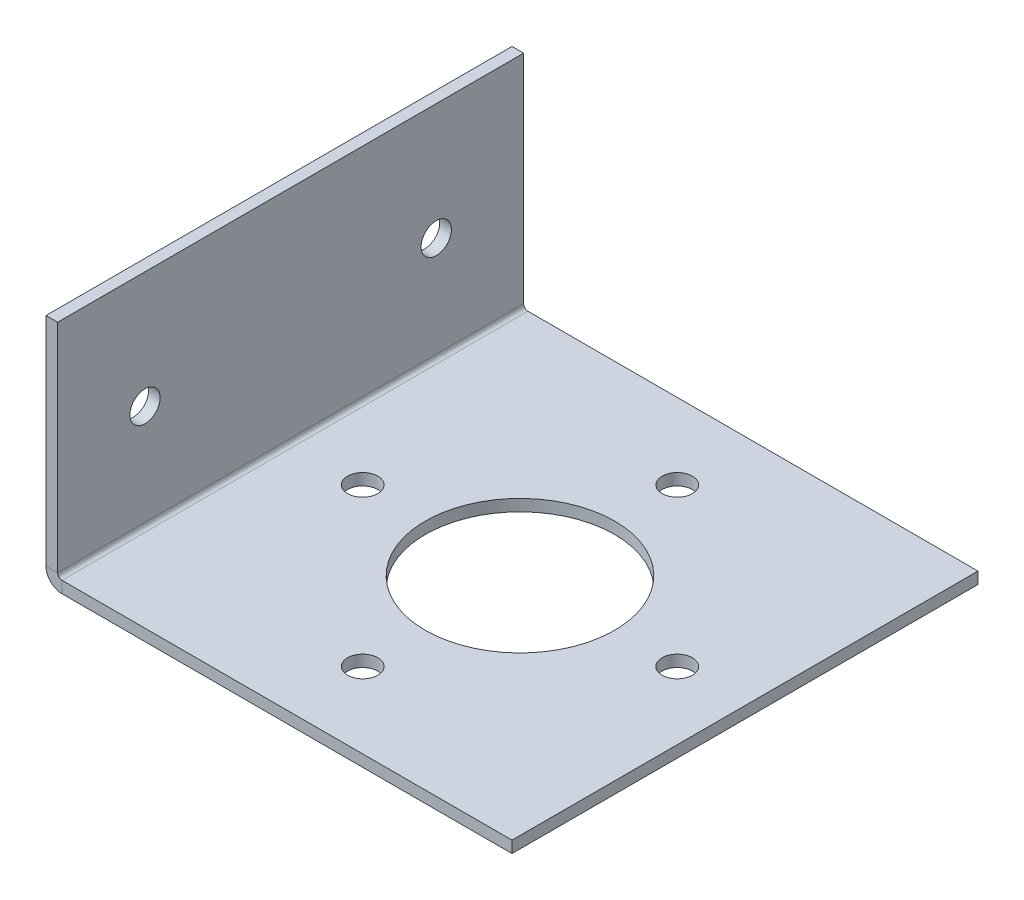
ISO-10303-21;
HEADER;
FILE_DESCRIPTION(('STEP AP214'),'2;1');
FILE_NAME('part.step','',(''),(''),'','','');
FILE_SCHEMA(('AUTOMOTIVE_DESIGN { 1 0 10303 214 1 1 1 1 }'));
ENDSEC;
DATA;
#1=APPLICATION_CONTEXT('core data for automotive mechanical design processes');
#2=APPLICATION_PROTOCOL_DEFINITION('international standard','automotive_design',2000,#1);
#3=PRODUCT_CONTEXT('',#1,'mechanical');
#4=PRODUCT('Part','Part','',(#3));
#5=PRODUCT_RELATED_PRODUCT_CATEGORY('part','',(#4));
#6=PRODUCT_DEFINITION_FORMATION('','',#4);
#7=PRODUCT_DEFINITION_CONTEXT('part definition',#1,'design');
#8=PRODUCT_DEFINITION('design','',#6,#7);
#9=PRODUCT_DEFINITION_SHAPE('','',#8);
#10=(LENGTH_UNIT() NAMED_UNIT(*) SI_UNIT(.MILLI.,.METRE.));
#11=(NAMED_UNIT(*) PLANE_ANGLE_UNIT() SI_UNIT($,.RADIAN.));
#12=(NAMED_UNIT(*) SI_UNIT($,.STERADIAN.) SOLID_ANGLE_UNIT());
#13=UNCERTAINTY_MEASURE_WITH_UNIT(LENGTH_MEASURE(1.E-05),#10,'distance_accuracy_value','');
#14=(GEOMETRIC_REPRESENTATION_CONTEXT(3) GLOBAL_UNCERTAINTY_ASSIGNED_CONTEXT((#13)) GLOBAL_UNIT_ASSIGNED_CONTEXT((#10,
#11,#12)) REPRESENTATION_CONTEXT('',''));
#15=CARTESIAN_POINT('',(0.,0.,0.));
#16=DIRECTION('',(0.,0.,1.));
#17=DIRECTION('',(1.,0.,0.));
#18=AXIS2_PLACEMENT_3D('',#15,#16,#17);
#19=CARTESIAN_POINT('',(0.,2.7366,80.));
#20=DIRECTION('',(0.,0.,1.));
#21=DIRECTION('',(1.,0.,0.));
#22=AXIS2_PLACEMENT_3D('',#19,#20,#21);
#23=PLANE('',#22);
#24=DIRECTION('',(1.,0.,0.));
#25=VECTOR('',#24,1.);
#26=CARTESIAN_POINT('',(0.,2.7366,80.));
#27=LINE('',#26,#25);
#28=CARTESIAN_POINT('',(0.,2.7366,80.));
#29=VERTEX_POINT('',#28);
#30=CARTESIAN_POINT('',(2.,2.7366,80.));
#31=VERTEX_POINT('',#30);
#32=EDGE_CURVE('E11',#29,#31,#27,.T.);
#33=ORIENTED_EDGE('',*,*,#32,.F.);
#34=CARTESIAN_POINT('',(2.7366,2.7366,80.));
#35=DIRECTION('',(0.,0.,1.));
#36=DIRECTION('',(1.,0.,0.));
#37=AXIS2_PLACEMENT_3D('',#34,#35,#36);
#38=CIRCLE('',#37,2.7366);
#39=CARTESIAN_POINT('',(2.7366,0.,80.));
#40=VERTEX_POINT('',#39);
#41=EDGE_CURVE('E147',#40,#29,#38,.F.);
#42=ORIENTED_EDGE('',*,*,#41,.F.);
#43=DIRECTION('',(0.,-1.,0.));
#44=VECTOR('',#43,1.);
#45=CARTESIAN_POINT('',(2.7366,2.,80.));
#46=LINE('',#45,#44);
#47=CARTESIAN_POINT('',(2.7366,2.,80.));
#48=VERTEX_POINT('',#47);
#49=EDGE_CURVE('E57',#48,#40,#46,.T.);
#50=ORIENTED_EDGE('',*,*,#49,.F.);
#51=CARTESIAN_POINT('',(2.7366,2.7366,80.));
#52=DIRECTION('',(0.,0.,1.));
#53=DIRECTION('',(1.,0.,0.));
#54=AXIS2_PLACEMENT_3D('',#51,#52,#53);
#55=CIRCLE('',#54,0.7366);
#56=EDGE_CURVE('E140',#48,#31,#55,.F.);
#57=ORIENTED_EDGE('',*,*,#56,.T.);
#58=EDGE_LOOP('',(#33,#42,#50,#57));
#59=FACE_BOUND('',#58,.T.);
#60=ADVANCED_FACE('F48',(#59),#23,.T.);
#61=CARTESIAN_POINT('',(2.7366,2.,80.));
#62=DIRECTION('',(0.,0.,1.));
#63=DIRECTION('',(1.,0.,0.));
#64=AXIS2_PLACEMENT_3D('',#61,#62,#63);
#65=PLANE('',#64);
#66=DIRECTION('',(0.,1.,0.));
#67=VECTOR('',#66,1.);
#68=CARTESIAN_POINT('',(0.,0.,80.));
#69=LINE('',#68,#67);
#70=CARTESIAN_POINT('',(0.,40.,80.));
#71=VERTEX_POINT('',#70);
#72=EDGE_CURVE('E238',#29,#71,#69,.T.);
#73=ORIENTED_EDGE('',*,*,#72,.F.);
#74=ORIENTED_EDGE('',*,*,#32,.T.);
#75=DIRECTION('',(0.,1.,0.));
#76=VECTOR('',#75,1.);
#77=CARTESIAN_POINT('',(2.,0.,80.));
#78=LINE('',#77,#76);
#79=CARTESIAN_POINT('',(2.,40.,80.));
#80=VERTEX_POINT('',#79);
#81=EDGE_CURVE('E106',#31,#80,#78,.T.);
#82=ORIENTED_EDGE('',*,*,#81,.T.);
#83=DIRECTION('',(1.,0.,0.));
#84=VECTOR('',#83,1.);
#85=CARTESIAN_POINT('',(0.,40.,80.));
#86=LINE('',#85,#84);
#87=EDGE_CURVE('E242',#71,#80,#86,.T.);
#88=ORIENTED_EDGE('',*,*,#87,.F.);
#89=EDGE_LOOP('',(#73,#74,#82,#88));
#90=FACE_BOUND('',#89,.T.);
#91=ADVANCED_FACE('F224',(#90),#65,.T.);
#92=CARTESIAN_POINT('',(2.7366,0.,0.));
#93=DIRECTION('',(0.,0.,-1.));
#94=DIRECTION('',(-1.,0.,0.));
#95=AXIS2_PLACEMENT_3D('',#92,#93,#94);
#96=PLANE('',#95);
#97=DIRECTION('',(0.,1.,0.));
#98=VECTOR('',#97,1.);
#99=CARTESIAN_POINT('',(2.7366,0.,0.));
#100=LINE('',#99,#98);
#101=CARTESIAN_POINT('',(2.7366,0.,0.));
#102=VERTEX_POINT('',#101);
#103=CARTESIAN_POINT('',(2.7366,2.,0.));
#104=VERTEX_POINT('',#103);
#105=EDGE_CURVE('E93',#102,#104,#100,.T.);
#106=ORIENTED_EDGE('',*,*,#105,.F.);
#107=CARTESIAN_POINT('',(2.7366,2.7366,0.));
#108=DIRECTION('',(0.,0.,1.));
#109=DIRECTION('',(1.,0.,0.));
#110=AXIS2_PLACEMENT_3D('',#107,#108,#109);
#111=CIRCLE('',#110,2.7366);
#112=CARTESIAN_POINT('',(0.,2.7366,0.));
#113=VERTEX_POINT('',#112);
#114=EDGE_CURVE('E162',#102,#113,#111,.F.);
#115=ORIENTED_EDGE('',*,*,#114,.T.);
#116=DIRECTION('',(-1.,0.,0.));
#117=VECTOR('',#116,1.);
#118=CARTESIAN_POINT('',(2.,2.7366,0.));
#119=LINE('',#118,#117);
#120=CARTESIAN_POINT('',(2.,2.7366,0.));
#121=VERTEX_POINT('',#120);
#122=EDGE_CURVE('E100',#121,#113,#119,.T.);
#123=ORIENTED_EDGE('',*,*,#122,.F.);
#124=CARTESIAN_POINT('',(2.7366,2.7366,0.));
#125=DIRECTION('',(0.,0.,1.));
#126=DIRECTION('',(1.,0.,0.));
#127=AXIS2_PLACEMENT_3D('',#124,#125,#126);
#128=CIRCLE('',#127,0.7366);
#129=EDGE_CURVE('E169',#104,#121,#128,.F.);
#130=ORIENTED_EDGE('',*,*,#129,.F.);
#131=EDGE_LOOP('',(#106,#115,#123,#130));
#132=FACE_BOUND('',#131,.T.);
#133=ADVANCED_FACE('F229',(#132),#96,.T.);
#134=CARTESIAN_POINT('',(2.,2.7366,0.));
#135=DIRECTION('',(0.,0.,-1.));
#136=DIRECTION('',(-1.,0.,0.));
#137=AXIS2_PLACEMENT_3D('',#134,#135,#136);
#138=PLANE('',#137);
#139=DIRECTION('',(-1.,0.,0.));
#140=VECTOR('',#139,1.);
#141=CARTESIAN_POINT('',(0.,0.,0.));
#142=LINE('',#141,#140);
#143=CARTESIAN_POINT('',(80.,0.,0.));
#144=VERTEX_POINT('',#143);
#145=EDGE_CURVE('E164',#144,#102,#142,.T.);
#146=ORIENTED_EDGE('',*,*,#145,.T.);
#147=ORIENTED_EDGE('',*,*,#105,.T.);
#148=DIRECTION('',(1.,0.,0.));
#149=VECTOR('',#148,1.);
#150=CARTESIAN_POINT('',(0.,2.,0.));
#151=LINE('',#150,#149);
#152=CARTESIAN_POINT('',(80.,2.,0.));
#153=VERTEX_POINT('',#152);
#154=EDGE_CURVE('E167',#153,#104,#151,.F.);
#155=ORIENTED_EDGE('',*,*,#154,.F.);
#156=DIRECTION('',(0.,-1.,0.));
#157=VECTOR('',#156,1.);
#158=CARTESIAN_POINT('',(80.,2.,0.));
#159=LINE('',#158,#157);
#160=EDGE_CURVE('E128',#153,#144,#159,.T.);
#161=ORIENTED_EDGE('',*,*,#160,.T.);
#162=EDGE_LOOP('',(#146,#147,#155,#161));
#163=FACE_BOUND('',#162,.T.);
#164=ADVANCED_FACE('F288',(#163),#138,.T.);
#165=CARTESIAN_POINT('',(2.,0.,80.));
#166=DIRECTION('',(-1.,0.,0.));
#167=DIRECTION('',(0.,0.,1.));
#168=AXIS2_PLACEMENT_3D('',#165,#166,#167);
#169=PLANE('',#168);
#170=CARTESIAN_POINT('',(2.,20.,65.));
#171=DIRECTION('',(-1.,0.,0.));
#172=DIRECTION('',(0.,0.,1.));
#173=AXIS2_PLACEMENT_3D('',#170,#171,#172);
#174=CIRCLE('',#173,2.6);
#175=CARTESIAN_POINT('',(2.,20.,67.6));
#176=VERTEX_POINT('',#175);
#177=EDGE_CURVE('E259',#176,#176,#174,.T.);
#178=ORIENTED_EDGE('',*,*,#177,.T.);
#179=EDGE_LOOP('',(#178));
#180=FACE_BOUND('',#179,.T.);
#181=CARTESIAN_POINT('',(2.,20.,15.));
#182=DIRECTION('',(-1.,0.,0.));
#183=DIRECTION('',(0.,0.,1.));
#184=AXIS2_PLACEMENT_3D('',#181,#182,#183);
#185=CIRCLE('',#184,2.6);
#186=CARTESIAN_POINT('',(2.,20.,17.6));
#187=VERTEX_POINT('',#186);
#188=EDGE_CURVE('E265',#187,#187,#185,.T.);
#189=ORIENTED_EDGE('',*,*,#188,.T.);
#190=EDGE_LOOP('',(#189));
#191=FACE_BOUND('',#190,.T.);
#192=DIRECTION('',(0.,1.,0.));
#193=VECTOR('',#192,1.);
#194=CARTESIAN_POINT('',(2.,0.,0.));
#195=LINE('',#194,#193);
#196=CARTESIAN_POINT('',(2.,40.,0.));
#197=VERTEX_POINT('',#196);
#198=EDGE_CURVE('E153',#121,#197,#195,.T.);
#199=ORIENTED_EDGE('',*,*,#198,.T.);
#200=DIRECTION('',(0.,0.,-1.));
#201=VECTOR('',#200,1.);
#202=CARTESIAN_POINT('',(2.,40.,80.));
#203=LINE('',#202,#201);
#204=EDGE_CURVE('E183',#80,#197,#203,.T.);
#205=ORIENTED_EDGE('',*,*,#204,.F.);
#206=ORIENTED_EDGE('',*,*,#81,.F.);
#207=DIRECTION('',(0.,0.,-1.));
#208=VECTOR('',#207,1.);
#209=CARTESIAN_POINT('',(2.,2.7366,80.));
#210=LINE('',#209,#208);
#211=EDGE_CURVE('E152',#31,#121,#210,.T.);
#212=ORIENTED_EDGE('',*,*,#211,.T.);
#213=EDGE_LOOP('',(#199,#205,#206,#212));
#214=FACE_BOUND('',#213,.T.);
#215=ADVANCED_FACE('F285',(#180,#191,#214),#169,.F.);
#216=CARTESIAN_POINT('',(0.,40.,80.));
#217=DIRECTION('',(0.,1.,0.));
#218=DIRECTION('',(0.,0.,1.));
#219=AXIS2_PLACEMENT_3D('',#216,#217,#218);
#220=PLANE('',#219);
#221=DIRECTION('',(1.,0.,0.));
#222=VECTOR('',#221,1.);
#223=CARTESIAN_POINT('',(0.,40.,0.));
#224=LINE('',#223,#222);
#225=CARTESIAN_POINT('',(0.,40.,0.));
#226=VERTEX_POINT('',#225);
#227=EDGE_CURVE('E156',#226,#197,#224,.T.);
#228=ORIENTED_EDGE('',*,*,#227,.F.);
#229=DIRECTION('',(0.,0.,-1.));
#230=VECTOR('',#229,1.);
#231=CARTESIAN_POINT('',(0.,40.,80.));
#232=LINE('',#231,#230);
#233=EDGE_CURVE('E181',#71,#226,#232,.T.);
#234=ORIENTED_EDGE('',*,*,#233,.F.);
#235=ORIENTED_EDGE('',*,*,#87,.T.);
#236=ORIENTED_EDGE('',*,*,#204,.T.);
#237=EDGE_LOOP('',(#228,#234,#235,#236));
#238=FACE_BOUND('',#237,.T.);
#239=ADVANCED_FACE('F279',(#238),#220,.T.);
#240=CARTESIAN_POINT('',(0.,0.,80.));
#241=DIRECTION('',(-1.,0.,0.));
#242=DIRECTION('',(0.,0.,1.));
#243=AXIS2_PLACEMENT_3D('',#240,#241,#242);
#244=PLANE('',#243);
#245=CARTESIAN_POINT('',(0.,20.,65.));
#246=DIRECTION('',(-1.,0.,0.));
#247=DIRECTION('',(0.,0.,1.));
#248=AXIS2_PLACEMENT_3D('',#245,#246,#247);
#249=CIRCLE('',#248,2.6);
#250=CARTESIAN_POINT('',(0.,20.,67.6));
#251=VERTEX_POINT('',#250);
#252=EDGE_CURVE('E268',#251,#251,#249,.T.);
#253=ORIENTED_EDGE('',*,*,#252,.F.);
#254=EDGE_LOOP('',(#253));
#255=FACE_BOUND('',#254,.T.);
#256=CARTESIAN_POINT('',(0.,20.,15.));
#257=DIRECTION('',(-1.,0.,0.));
#258=DIRECTION('',(0.,0.,1.));
#259=AXIS2_PLACEMENT_3D('',#256,#257,#258);
#260=CIRCLE('',#259,2.6);
#261=CARTESIAN_POINT('',(0.,20.,17.6));
#262=VERTEX_POINT('',#261);
#263=EDGE_CURVE('E269',#262,#262,#260,.T.);
#264=ORIENTED_EDGE('',*,*,#263,.F.);
#265=EDGE_LOOP('',(#264));
#266=FACE_BOUND('',#265,.T.);
#267=DIRECTION('',(0.,1.,0.));
#268=VECTOR('',#267,1.);
#269=CARTESIAN_POINT('',(0.,0.,0.));
#270=LINE('',#269,#268);
#271=EDGE_CURVE('E159',#113,#226,#270,.T.);
#272=ORIENTED_EDGE('',*,*,#271,.F.);
#273=DIRECTION('',(0.,0.,-1.));
#274=VECTOR('',#273,1.);
#275=CARTESIAN_POINT('',(0.,2.7366,80.));
#276=LINE('',#275,#274);
#277=EDGE_CURVE('E178',#29,#113,#276,.T.);
#278=ORIENTED_EDGE('',*,*,#277,.F.);
#279=ORIENTED_EDGE('',*,*,#72,.T.);
#280=ORIENTED_EDGE('',*,*,#233,.T.);
#281=EDGE_LOOP('',(#272,#278,#279,#280));
#282=FACE_BOUND('',#281,.T.);
#283=ADVANCED_FACE('F237',(#255,#266,#282),#244,.T.);
#284=CARTESIAN_POINT('',(2.7366,2.7366,80.));
#285=DIRECTION('',(0.,0.,-1.));
#286=DIRECTION('',(-1.,0.,0.));
#287=AXIS2_PLACEMENT_3D('',#284,#285,#286);
#288=CYLINDRICAL_SURFACE('',#287,2.7366);
#289=ORIENTED_EDGE('',*,*,#114,.F.);
#290=DIRECTION('',(0.,0.,-1.));
#291=VECTOR('',#290,1.);
#292=CARTESIAN_POINT('',(2.7366,0.,80.));
#293=LINE('',#292,#291);
#294=EDGE_CURVE('E175',#40,#102,#293,.T.);
#295=ORIENTED_EDGE('',*,*,#294,.F.);
#296=ORIENTED_EDGE('',*,*,#41,.T.);
#297=ORIENTED_EDGE('',*,*,#277,.T.);
#298=EDGE_LOOP('',(#289,#295,#296,#297));
#299=FACE_BOUND('',#298,.T.);
#300=ADVANCED_FACE('F245',(#299),#288,.T.);
#301=CARTESIAN_POINT('',(0.,0.,80.));
#302=DIRECTION('',(0.,-1.,0.));
#303=DIRECTION('',(0.,0.,-1.));
#304=AXIS2_PLACEMENT_3D('',#301,#302,#303);
#305=PLANE('',#304);
#306=CARTESIAN_POINT('',(41.3682999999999,0.,13.0000000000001));
#307=DIRECTION('',(0.,-1.,0.));
#308=DIRECTION('',(0.,0.,-1.));
#309=AXIS2_PLACEMENT_3D('',#306,#307,#308);
#310=CIRCLE('',#309,2.6);
#311=CARTESIAN_POINT('',(41.3682999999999,0.,10.4000000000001));
#312=VERTEX_POINT('',#311);
#313=EDGE_CURVE('E192',#312,#312,#310,.T.);
#314=ORIENTED_EDGE('',*,*,#313,.F.);
#315=EDGE_LOOP('',(#314));
#316=FACE_BOUND('',#315,.T.);
#317=CARTESIAN_POINT('',(41.3683,0.,40.));
#318=DIRECTION('',(0.,-1.,0.));
#319=DIRECTION('',(0.,0.,-1.));
#320=AXIS2_PLACEMENT_3D('',#317,#318,#319);
#321=CIRCLE('',#320,16.25);
#322=CARTESIAN_POINT('',(41.3683,0.,23.75));
#323=VERTEX_POINT('',#322);
#324=EDGE_CURVE('E256',#323,#323,#321,.T.);
#325=ORIENTED_EDGE('',*,*,#324,.F.);
#326=EDGE_LOOP('',(#325));
#327=FACE_BOUND('',#326,.T.);
#328=CARTESIAN_POINT('',(41.3683,0.,67.0000000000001));
#329=DIRECTION('',(0.,-1.,0.));
#330=DIRECTION('',(0.,0.,-1.));
#331=AXIS2_PLACEMENT_3D('',#328,#329,#330);
#332=CIRCLE('',#331,2.6);
#333=CARTESIAN_POINT('',(41.3683,0.,64.4000000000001));
#334=VERTEX_POINT('',#333);
#335=EDGE_CURVE('E253',#334,#334,#332,.T.);
#336=ORIENTED_EDGE('',*,*,#335,.F.);
#337=EDGE_LOOP('',(#336));
#338=FACE_BOUND('',#337,.T.);
#339=CARTESIAN_POINT('',(68.3682999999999,0.,40.0000000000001));
#340=DIRECTION('',(0.,-1.,0.));
#341=DIRECTION('',(0.,0.,-1.));
#342=AXIS2_PLACEMENT_3D('',#339,#340,#341);
#343=CIRCLE('',#342,2.6);
#344=CARTESIAN_POINT('',(68.3682999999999,0.,37.4000000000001));
#345=VERTEX_POINT('',#344);
#346=EDGE_CURVE('E249',#345,#345,#343,.T.);
#347=ORIENTED_EDGE('',*,*,#346,.F.);
#348=EDGE_LOOP('',(#347));
#349=FACE_BOUND('',#348,.T.);
#350=CARTESIAN_POINT('',(14.3683,0.,40.0000000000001));
#351=DIRECTION('',(0.,-1.,0.));
#352=DIRECTION('',(0.,0.,-1.));
#353=AXIS2_PLACEMENT_3D('',#350,#351,#352);
#354=CIRCLE('',#353,2.6);
#355=CARTESIAN_POINT('',(14.3683,0.,37.4000000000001));
#356=VERTEX_POINT('',#355);
#357=EDGE_CURVE('E252',#356,#356,#354,.T.);
#358=ORIENTED_EDGE('',*,*,#357,.F.);
#359=EDGE_LOOP('',(#358));
#360=FACE_BOUND('',#359,.T.);
#361=ORIENTED_EDGE('',*,*,#145,.F.);
#362=DIRECTION('',(0.,0.,-1.));
#363=VECTOR('',#362,1.);
#364=CARTESIAN_POINT('',(80.,0.,80.));
#365=LINE('',#364,#363);
#366=CARTESIAN_POINT('',(80.,0.,80.));
#367=VERTEX_POINT('',#366);
#368=EDGE_CURVE('E130',#367,#144,#365,.T.);
#369=ORIENTED_EDGE('',*,*,#368,.F.);
#370=DIRECTION('',(-1.,0.,0.));
#371=VECTOR('',#370,1.);
#372=CARTESIAN_POINT('',(0.,0.,80.));
#373=LINE('',#372,#371);
#374=EDGE_CURVE('E145',#367,#40,#373,.T.);
#375=ORIENTED_EDGE('',*,*,#374,.T.);
#376=ORIENTED_EDGE('',*,*,#294,.T.);
#377=EDGE_LOOP('',(#361,#369,#375,#376));
#378=FACE_BOUND('',#377,.T.);
#379=ADVANCED_FACE('F309',(#316,#327,#338,#349,#360,#378),#305,.T.);
#380=CARTESIAN_POINT('',(80.,2.,80.));
#381=DIRECTION('',(1.,0.,0.));
#382=DIRECTION('',(0.,0.,-1.));
#383=AXIS2_PLACEMENT_3D('',#380,#381,#382);
#384=PLANE('',#383);
#385=ORIENTED_EDGE('',*,*,#160,.F.);
#386=DIRECTION('',(0.,0.,-1.));
#387=VECTOR('',#386,1.);
#388=CARTESIAN_POINT('',(80.,2.,80.));
#389=LINE('',#388,#387);
#390=CARTESIAN_POINT('',(80.,2.,80.));
#391=VERTEX_POINT('',#390);
#392=EDGE_CURVE('E122',#391,#153,#389,.T.);
#393=ORIENTED_EDGE('',*,*,#392,.F.);
#394=DIRECTION('',(0.,-1.,0.));
#395=VECTOR('',#394,1.);
#396=CARTESIAN_POINT('',(80.,2.,80.));
#397=LINE('',#396,#395);
#398=EDGE_CURVE('E126',#391,#367,#397,.T.);
#399=ORIENTED_EDGE('',*,*,#398,.T.);
#400=ORIENTED_EDGE('',*,*,#368,.T.);
#401=EDGE_LOOP('',(#385,#393,#399,#400));
#402=FACE_BOUND('',#401,.T.);
#403=ADVANCED_FACE('F124',(#402),#384,.T.);
#404=CARTESIAN_POINT('',(0.,2.,80.));
#405=DIRECTION('',(0.,-1.,0.));
#406=DIRECTION('',(0.,0.,-1.));
#407=AXIS2_PLACEMENT_3D('',#404,#405,#406);
#408=PLANE('',#407);
#409=CARTESIAN_POINT('',(41.3682999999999,2.,13.0000000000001));
#410=DIRECTION('',(0.,-1.,0.));
#411=DIRECTION('',(0.,0.,-1.));
#412=AXIS2_PLACEMENT_3D('',#409,#410,#411);
#413=CIRCLE('',#412,2.6);
#414=CARTESIAN_POINT('',(41.3682999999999,2.,10.4000000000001));
#415=VERTEX_POINT('',#414);
#416=EDGE_CURVE('E51',#415,#415,#413,.T.);
#417=ORIENTED_EDGE('',*,*,#416,.T.);
#418=EDGE_LOOP('',(#417));
#419=FACE_BOUND('',#418,.T.);
#420=CARTESIAN_POINT('',(41.3683,2.,40.));
#421=DIRECTION('',(0.,-1.,0.));
#422=DIRECTION('',(0.,0.,-1.));
#423=AXIS2_PLACEMENT_3D('',#420,#421,#422);
#424=CIRCLE('',#423,16.25);
#425=CARTESIAN_POINT('',(41.3683,2.,23.75));
#426=VERTEX_POINT('',#425);
#427=EDGE_CURVE('E197',#426,#426,#424,.T.);
#428=ORIENTED_EDGE('',*,*,#427,.T.);
#429=EDGE_LOOP('',(#428));
#430=FACE_BOUND('',#429,.T.);
#431=CARTESIAN_POINT('',(41.3683,2.,67.0000000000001));
#432=DIRECTION('',(0.,-1.,0.));
#433=DIRECTION('',(0.,0.,-1.));
#434=AXIS2_PLACEMENT_3D('',#431,#432,#433);
#435=CIRCLE('',#434,2.6);
#436=CARTESIAN_POINT('',(41.3683,2.,64.4000000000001));
#437=VERTEX_POINT('',#436);
#438=EDGE_CURVE('E195',#437,#437,#435,.T.);
#439=ORIENTED_EDGE('',*,*,#438,.T.);
#440=EDGE_LOOP('',(#439));
#441=FACE_BOUND('',#440,.T.);
#442=CARTESIAN_POINT('',(68.3682999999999,2.,40.0000000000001));
#443=DIRECTION('',(0.,-1.,0.));
#444=DIRECTION('',(0.,0.,-1.));
#445=AXIS2_PLACEMENT_3D('',#442,#443,#444);
#446=CIRCLE('',#445,2.6);
#447=CARTESIAN_POINT('',(68.3682999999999,2.,37.4000000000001));
#448=VERTEX_POINT('',#447);
#449=EDGE_CURVE('E191',#448,#448,#446,.T.);
#450=ORIENTED_EDGE('',*,*,#449,.T.);
#451=EDGE_LOOP('',(#450));
#452=FACE_BOUND('',#451,.T.);
#453=CARTESIAN_POINT('',(14.3683,2.,40.0000000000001));
#454=DIRECTION('',(0.,-1.,0.));
#455=DIRECTION('',(0.,0.,-1.));
#456=AXIS2_PLACEMENT_3D('',#453,#454,#455);
#457=CIRCLE('',#456,2.6);
#458=CARTESIAN_POINT('',(14.3683,2.,37.4000000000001));
#459=VERTEX_POINT('',#458);
#460=EDGE_CURVE('E188',#459,#459,#457,.T.);
#461=ORIENTED_EDGE('',*,*,#460,.T.);
#462=EDGE_LOOP('',(#461));
#463=FACE_BOUND('',#462,.T.);
#464=ORIENTED_EDGE('',*,*,#154,.T.);
#465=DIRECTION('',(0.,0.,-1.));
#466=VECTOR('',#465,1.);
#467=CARTESIAN_POINT('',(2.7366,2.,80.));
#468=LINE('',#467,#466);
#469=EDGE_CURVE('E131',#48,#104,#468,.T.);
#470=ORIENTED_EDGE('',*,*,#469,.F.);
#471=DIRECTION('',(1.,0.,0.));
#472=VECTOR('',#471,1.);
#473=CARTESIAN_POINT('',(0.,2.,80.));
#474=LINE('',#473,#472);
#475=EDGE_CURVE('E135',#391,#48,#474,.F.);
#476=ORIENTED_EDGE('',*,*,#475,.F.);
#477=ORIENTED_EDGE('',*,*,#392,.T.);
#478=EDGE_LOOP('',(#464,#470,#476,#477));
#479=FACE_BOUND('',#478,.T.);
#480=ADVANCED_FACE('F136',(#419,#430,#441,#452,#463,#479),#408,.F.);
#481=CARTESIAN_POINT('',(2.7366,2.7366,80.));
#482=DIRECTION('',(0.,0.,-1.));
#483=DIRECTION('',(-1.,0.,0.));
#484=AXIS2_PLACEMENT_3D('',#481,#482,#483);
#485=CYLINDRICAL_SURFACE('',#484,0.7366);
#486=ORIENTED_EDGE('',*,*,#129,.T.);
#487=ORIENTED_EDGE('',*,*,#211,.F.);
#488=ORIENTED_EDGE('',*,*,#56,.F.);
#489=ORIENTED_EDGE('',*,*,#469,.T.);
#490=EDGE_LOOP('',(#486,#487,#488,#489));
#491=FACE_BOUND('',#490,.T.);
#492=ADVANCED_FACE('F311',(#491),#485,.F.);
#493=CARTESIAN_POINT('',(2.7366,2.7366,80.));
#494=DIRECTION('',(0.,0.,1.));
#495=DIRECTION('',(1.,0.,0.));
#496=AXIS2_PLACEMENT_3D('',#493,#494,#495);
#497=PLANE('',#496);
#498=ORIENTED_EDGE('',*,*,#475,.T.);
#499=ORIENTED_EDGE('',*,*,#49,.T.);
#500=ORIENTED_EDGE('',*,*,#374,.F.);
#501=ORIENTED_EDGE('',*,*,#398,.F.);
#502=EDGE_LOOP('',(#498,#499,#500,#501));
#503=FACE_BOUND('',#502,.T.);
#504=ADVANCED_FACE('F143',(#503),#497,.T.);
#505=CARTESIAN_POINT('',(2.7366,2.7366,0.));
#506=DIRECTION('',(0.,0.,1.));
#507=DIRECTION('',(1.,0.,0.));
#508=AXIS2_PLACEMENT_3D('',#505,#506,#507);
#509=PLANE('',#508);
#510=ORIENTED_EDGE('',*,*,#198,.F.);
#511=ORIENTED_EDGE('',*,*,#122,.T.);
#512=ORIENTED_EDGE('',*,*,#271,.T.);
#513=ORIENTED_EDGE('',*,*,#227,.T.);
#514=EDGE_LOOP('',(#510,#511,#512,#513));
#515=FACE_BOUND('',#514,.T.);
#516=ADVANCED_FACE('F294',(#515),#509,.F.);
#517=CARTESIAN_POINT('',(14.3683,10.,40.0000000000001));
#518=DIRECTION('',(0.,-1.,0.));
#519=DIRECTION('',(0.,0.,-1.));
#520=AXIS2_PLACEMENT_3D('',#517,#518,#519);
#521=CYLINDRICAL_SURFACE('',#520,2.6);
#522=ORIENTED_EDGE('',*,*,#357,.T.);
#523=EDGE_LOOP('',(#522));
#524=FACE_BOUND('',#523,.T.);
#525=ORIENTED_EDGE('',*,*,#460,.F.);
#526=EDGE_LOOP('',(#525));
#527=FACE_BOUND('',#526,.T.);
#528=ADVANCED_FACE('F363',(#524,#527),#521,.F.);
#529=CARTESIAN_POINT('',(68.3682999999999,10.,40.0000000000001));
#530=DIRECTION('',(0.,-1.,0.));
#531=DIRECTION('',(0.,0.,-1.));
#532=AXIS2_PLACEMENT_3D('',#529,#530,#531);
#533=CYLINDRICAL_SURFACE('',#532,2.6);
#534=ORIENTED_EDGE('',*,*,#346,.T.);
#535=EDGE_LOOP('',(#534));
#536=FACE_BOUND('',#535,.T.);
#537=ORIENTED_EDGE('',*,*,#449,.F.);
#538=EDGE_LOOP('',(#537));
#539=FACE_BOUND('',#538,.T.);
#540=ADVANCED_FACE('F370',(#536,#539),#533,.F.);
#541=CARTESIAN_POINT('',(41.3683,10.,67.0000000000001));
#542=DIRECTION('',(0.,-1.,0.));
#543=DIRECTION('',(0.,0.,-1.));
#544=AXIS2_PLACEMENT_3D('',#541,#542,#543);
#545=CYLINDRICAL_SURFACE('',#544,2.6);
#546=ORIENTED_EDGE('',*,*,#335,.T.);
#547=EDGE_LOOP('',(#546));
#548=FACE_BOUND('',#547,.T.);
#549=ORIENTED_EDGE('',*,*,#438,.F.);
#550=EDGE_LOOP('',(#549));
#551=FACE_BOUND('',#550,.T.);
#552=ADVANCED_FACE('F218',(#548,#551),#545,.F.);
#553=CARTESIAN_POINT('',(41.3683,10.,40.));
#554=DIRECTION('',(0.,-1.,0.));
#555=DIRECTION('',(0.,0.,-1.));
#556=AXIS2_PLACEMENT_3D('',#553,#554,#555);
#557=CYLINDRICAL_SURFACE('',#556,16.25);
#558=ORIENTED_EDGE('',*,*,#324,.T.);
#559=EDGE_LOOP('',(#558));
#560=FACE_BOUND('',#559,.T.);
#561=ORIENTED_EDGE('',*,*,#427,.F.);
#562=EDGE_LOOP('',(#561));
#563=FACE_BOUND('',#562,.T.);
#564=ADVANCED_FACE('F208',(#560,#563),#557,.F.);
#565=CARTESIAN_POINT('',(41.3682999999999,10.,13.0000000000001));
#566=DIRECTION('',(0.,-1.,0.));
#567=DIRECTION('',(0.,0.,-1.));
#568=AXIS2_PLACEMENT_3D('',#565,#566,#567);
#569=CYLINDRICAL_SURFACE('',#568,2.6);
#570=ORIENTED_EDGE('',*,*,#313,.T.);
#571=EDGE_LOOP('',(#570));
#572=FACE_BOUND('',#571,.T.);
#573=ORIENTED_EDGE('',*,*,#416,.F.);
#574=EDGE_LOOP('',(#573));
#575=FACE_BOUND('',#574,.T.);
#576=ADVANCED_FACE('F205',(#572,#575),#569,.F.);
#577=CARTESIAN_POINT('',(10.,20.,15.));
#578=DIRECTION('',(-1.,0.,0.));
#579=DIRECTION('',(0.,0.,1.));
#580=AXIS2_PLACEMENT_3D('',#577,#578,#579);
#581=CYLINDRICAL_SURFACE('',#580,2.6);
#582=ORIENTED_EDGE('',*,*,#263,.T.);
#583=EDGE_LOOP('',(#582));
#584=FACE_BOUND('',#583,.T.);
#585=ORIENTED_EDGE('',*,*,#188,.F.);
#586=EDGE_LOOP('',(#585));
#587=FACE_BOUND('',#586,.T.);
#588=ADVANCED_FACE('F207',(#584,#587),#581,.F.);
#589=CARTESIAN_POINT('',(10.,20.,65.));
#590=DIRECTION('',(-1.,0.,0.));
#591=DIRECTION('',(0.,0.,1.));
#592=AXIS2_PLACEMENT_3D('',#589,#590,#591);
#593=CYLINDRICAL_SURFACE('',#592,2.6);
#594=ORIENTED_EDGE('',*,*,#252,.T.);
#595=EDGE_LOOP('',(#594));
#596=FACE_BOUND('',#595,.T.);
#597=ORIENTED_EDGE('',*,*,#177,.F.);
#598=EDGE_LOOP('',(#597));
#599=FACE_BOUND('',#598,.T.);
#600=ADVANCED_FACE('F215',(#596,#599),#593,.F.);
#601=CLOSED_SHELL('',(#60,#91,#133,#164,#215,#239,#283,#300,#379,#403,#480,#492,#504,#516,#528,
#540,#552,#564,#576,#588,#600));
#602=MANIFOLD_SOLID_BREP('B2',#601);
#603=ADVANCED_BREP_SHAPE_REPRESENTATION('',(#18,#602),#14);
#604=SHAPE_DEFINITION_REPRESENTATION(#9,#603);
ENDSEC;
END-ISO-10303-21;
